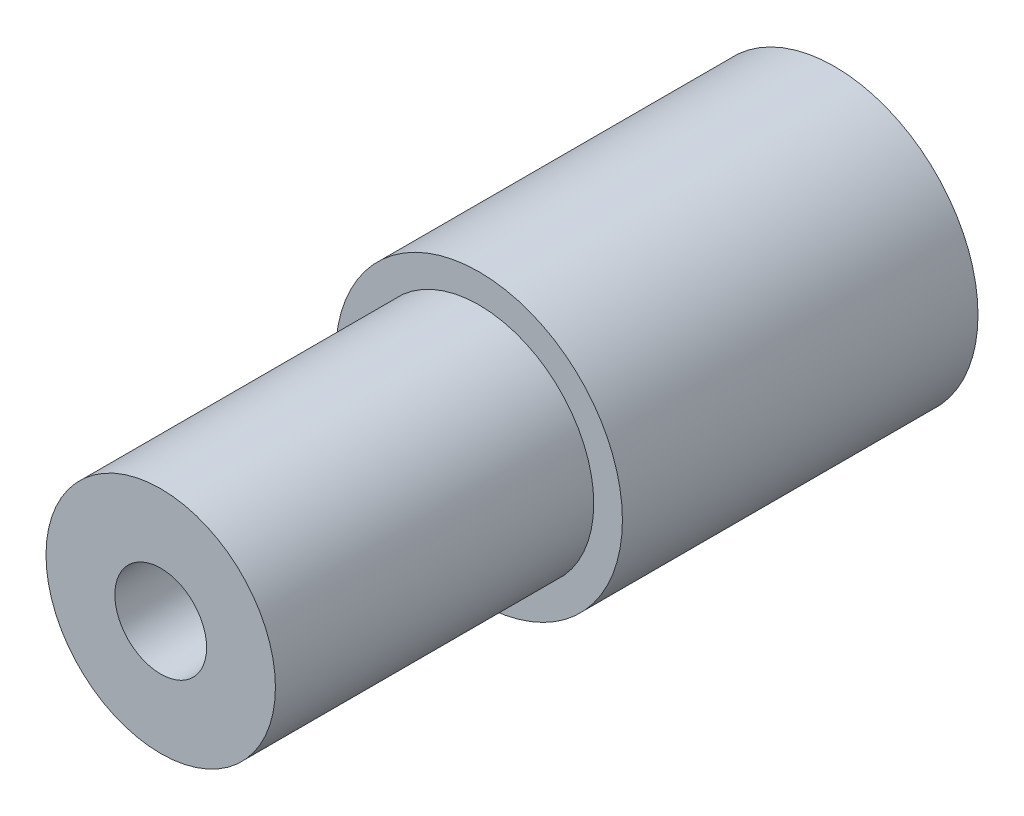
ISO-10303-21;
HEADER;
FILE_DESCRIPTION(('STEP AP214'),'2;1');
FILE_NAME('part.step','',(''),(''),'','','');
FILE_SCHEMA(('AUTOMOTIVE_DESIGN { 1 0 10303 214 1 1 1 1 }'));
ENDSEC;
DATA;
#1=APPLICATION_CONTEXT('core data for automotive mechanical design processes');
#2=APPLICATION_PROTOCOL_DEFINITION('international standard','automotive_design',2000,#1);
#3=PRODUCT_CONTEXT('',#1,'mechanical');
#4=PRODUCT('Part','Part','',(#3));
#5=PRODUCT_RELATED_PRODUCT_CATEGORY('part','',(#4));
#6=PRODUCT_DEFINITION_FORMATION('','',#4);
#7=PRODUCT_DEFINITION_CONTEXT('part definition',#1,'design');
#8=PRODUCT_DEFINITION('design','',#6,#7);
#9=PRODUCT_DEFINITION_SHAPE('','',#8);
#10=(LENGTH_UNIT() NAMED_UNIT(*) SI_UNIT(.MILLI.,.METRE.));
#11=(NAMED_UNIT(*) PLANE_ANGLE_UNIT() SI_UNIT($,.RADIAN.));
#12=(NAMED_UNIT(*) SI_UNIT($,.STERADIAN.) SOLID_ANGLE_UNIT());
#13=UNCERTAINTY_MEASURE_WITH_UNIT(LENGTH_MEASURE(1.E-05),#10,'distance_accuracy_value','');
#14=(GEOMETRIC_REPRESENTATION_CONTEXT(3) GLOBAL_UNCERTAINTY_ASSIGNED_CONTEXT((#13)) GLOBAL_UNIT_ASSIGNED_CONTEXT((#10,
#11,#12)) REPRESENTATION_CONTEXT('',''));
#15=CARTESIAN_POINT('',(0.,0.,0.));
#16=DIRECTION('',(0.,0.,1.));
#17=DIRECTION('',(1.,0.,0.));
#18=AXIS2_PLACEMENT_3D('',#15,#16,#17);
#19=CARTESIAN_POINT('',(0.,0.,23.5));
#20=DIRECTION('',(0.,0.,-1.));
#21=DIRECTION('',(-1.,0.,0.));
#22=AXIS2_PLACEMENT_3D('',#19,#20,#21);
#23=CYLINDRICAL_SURFACE('',#22,4.);
#24=CARTESIAN_POINT('',(0.,0.,23.5));
#25=DIRECTION('',(0.,0.,1.));
#26=DIRECTION('',(1.,0.,0.));
#27=AXIS2_PLACEMENT_3D('',#24,#25,#26);
#28=CIRCLE('',#27,4.);
#29=CARTESIAN_POINT('',(4.,0.,23.5));
#30=VERTEX_POINT('',#29);
#31=EDGE_CURVE('E44',#30,#30,#28,.T.);
#32=ORIENTED_EDGE('',*,*,#31,.F.);
#33=EDGE_LOOP('',(#32));
#34=FACE_BOUND('',#33,.T.);
#35=CARTESIAN_POINT('',(0.,0.,12.4));
#36=DIRECTION('',(0.,0.,-1.));
#37=DIRECTION('',(-1.,0.,0.));
#38=AXIS2_PLACEMENT_3D('',#35,#36,#37);
#39=CIRCLE('',#38,4.);
#40=CARTESIAN_POINT('',(-4.,0.,12.4));
#41=VERTEX_POINT('',#40);
#42=EDGE_CURVE('E10',#41,#41,#39,.T.);
#43=ORIENTED_EDGE('',*,*,#42,.F.);
#44=EDGE_LOOP('',(#43));
#45=FACE_BOUND('',#44,.T.);
#46=ADVANCED_FACE('F37',(#34,#45),#23,.T.);
#47=CARTESIAN_POINT('',(0.,0.,23.5));
#48=DIRECTION('',(0.,0.,1.));
#49=DIRECTION('',(1.,0.,0.));
#50=AXIS2_PLACEMENT_3D('',#47,#48,#49);
#51=PLANE('',#50);
#52=ORIENTED_EDGE('',*,*,#31,.T.);
#53=EDGE_LOOP('',(#52));
#54=FACE_BOUND('',#53,.T.);
#55=CARTESIAN_POINT('',(0.,0.,23.5));
#56=DIRECTION('',(0.,0.,1.));
#57=DIRECTION('',(1.,0.,0.));
#58=AXIS2_PLACEMENT_3D('',#55,#56,#57);
#59=CIRCLE('',#58,1.6);
#60=CARTESIAN_POINT('',(1.6,0.,23.5));
#61=VERTEX_POINT('',#60);
#62=EDGE_CURVE('E49',#61,#61,#59,.T.);
#63=ORIENTED_EDGE('',*,*,#62,.F.);
#64=EDGE_LOOP('',(#63));
#65=FACE_BOUND('',#64,.T.);
#66=ADVANCED_FACE('F81',(#54,#65),#51,.T.);
#67=CARTESIAN_POINT('',(0.,0.,0.));
#68=DIRECTION('',(0.,0.,1.));
#69=DIRECTION('',(1.,0.,0.));
#70=AXIS2_PLACEMENT_3D('',#67,#68,#69);
#71=PLANE('',#70);
#72=CARTESIAN_POINT('',(0.,0.,0.));
#73=DIRECTION('',(0.,0.,1.));
#74=DIRECTION('',(1.,0.,0.));
#75=AXIS2_PLACEMENT_3D('',#72,#73,#74);
#76=CIRCLE('',#75,1.6);
#77=CARTESIAN_POINT('',(1.6,0.,0.));
#78=VERTEX_POINT('',#77);
#79=EDGE_CURVE('E54',#78,#78,#76,.T.);
#80=ORIENTED_EDGE('',*,*,#79,.T.);
#81=EDGE_LOOP('',(#80));
#82=FACE_BOUND('',#81,.T.);
#83=CARTESIAN_POINT('',(0.,0.,0.));
#84=DIRECTION('',(0.,0.,-1.));
#85=DIRECTION('',(-1.,0.,0.));
#86=AXIS2_PLACEMENT_3D('',#83,#84,#85);
#87=CIRCLE('',#86,5.);
#88=CARTESIAN_POINT('',(-5.,0.,0.));
#89=VERTEX_POINT('',#88);
#90=EDGE_CURVE('E61',#89,#89,#87,.T.);
#91=ORIENTED_EDGE('',*,*,#90,.T.);
#92=EDGE_LOOP('',(#91));
#93=FACE_BOUND('',#92,.T.);
#94=ADVANCED_FACE('F86',(#82,#93),#71,.F.);
#95=CARTESIAN_POINT('',(0.,0.,23.5));
#96=DIRECTION('',(0.,0.,-1.));
#97=DIRECTION('',(-1.,0.,0.));
#98=AXIS2_PLACEMENT_3D('',#95,#96,#97);
#99=CYLINDRICAL_SURFACE('',#98,1.6);
#100=ORIENTED_EDGE('',*,*,#62,.T.);
#101=EDGE_LOOP('',(#100));
#102=FACE_BOUND('',#101,.T.);
#103=ORIENTED_EDGE('',*,*,#79,.F.);
#104=EDGE_LOOP('',(#103));
#105=FACE_BOUND('',#104,.T.);
#106=ADVANCED_FACE('F78',(#102,#105),#99,.F.);
#107=CARTESIAN_POINT('',(0.,0.,12.4));
#108=DIRECTION('',(0.,0.,-1.));
#109=DIRECTION('',(-1.,0.,0.));
#110=AXIS2_PLACEMENT_3D('',#107,#108,#109);
#111=CYLINDRICAL_SURFACE('',#110,5.);
#112=CARTESIAN_POINT('',(0.,0.,12.4));
#113=DIRECTION('',(0.,0.,-1.));
#114=DIRECTION('',(-1.,0.,0.));
#115=AXIS2_PLACEMENT_3D('',#112,#113,#114);
#116=CIRCLE('',#115,5.);
#117=CARTESIAN_POINT('',(-5.,0.,12.4));
#118=VERTEX_POINT('',#117);
#119=EDGE_CURVE('E59',#118,#118,#116,.T.);
#120=CARTESIAN_POINT('',(-5.,0.,12.4));
#121=CARTESIAN_POINT('',(-5.,0.,12.2708333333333));
#122=CARTESIAN_POINT('',(-5.,0.,12.1416666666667));
#123=CARTESIAN_POINT('',(-5.,0.,11.8833333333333));
#124=CARTESIAN_POINT('',(-5.,0.,11.7541666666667));
#125=CARTESIAN_POINT('',(-5.,0.,11.4958333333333));
#126=CARTESIAN_POINT('',(-5.,0.,11.3666666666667));
#127=CARTESIAN_POINT('',(-5.,0.,11.1083333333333));
#128=CARTESIAN_POINT('',(-5.,0.,10.9791666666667));
#129=CARTESIAN_POINT('',(-5.,0.,10.7208333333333));
#130=CARTESIAN_POINT('',(-5.,0.,10.5916666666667));
#131=CARTESIAN_POINT('',(-5.,0.,10.3333333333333));
#132=CARTESIAN_POINT('',(-5.,0.,10.2041666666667));
#133=CARTESIAN_POINT('',(-5.,0.,9.94583333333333));
#134=CARTESIAN_POINT('',(-5.,0.,9.81666666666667));
#135=CARTESIAN_POINT('',(-5.,0.,9.55833333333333));
#136=CARTESIAN_POINT('',(-5.,0.,9.42916666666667));
#137=CARTESIAN_POINT('',(-5.,0.,9.17083333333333));
#138=CARTESIAN_POINT('',(-5.,0.,9.04166666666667));
#139=CARTESIAN_POINT('',(-5.,0.,8.78333333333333));
#140=CARTESIAN_POINT('',(-5.,0.,8.65416666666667));
#141=CARTESIAN_POINT('',(-5.,0.,8.39583333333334));
#142=CARTESIAN_POINT('',(-5.,0.,8.26666666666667));
#143=CARTESIAN_POINT('',(-5.,0.,8.00833333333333));
#144=CARTESIAN_POINT('',(-5.,0.,7.87916666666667));
#145=CARTESIAN_POINT('',(-5.,0.,7.62083333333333));
#146=CARTESIAN_POINT('',(-5.,0.,7.49166666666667));
#147=CARTESIAN_POINT('',(-5.,0.,7.23333333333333));
#148=CARTESIAN_POINT('',(-5.,0.,7.10416666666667));
#149=CARTESIAN_POINT('',(-5.,0.,6.84583333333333));
#150=CARTESIAN_POINT('',(-5.,0.,6.71666666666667));
#151=CARTESIAN_POINT('',(-5.,0.,6.45833333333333));
#152=CARTESIAN_POINT('',(-5.,0.,6.32916666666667));
#153=CARTESIAN_POINT('',(-5.,0.,6.07083333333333));
#154=CARTESIAN_POINT('',(-5.,0.,5.94166666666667));
#155=CARTESIAN_POINT('',(-5.,0.,5.68333333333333));
#156=CARTESIAN_POINT('',(-5.,0.,5.55416666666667));
#157=CARTESIAN_POINT('',(-5.,0.,5.29583333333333));
#158=CARTESIAN_POINT('',(-5.,0.,5.16666666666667));
#159=CARTESIAN_POINT('',(-5.,0.,4.90833333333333));
#160=CARTESIAN_POINT('',(-5.,0.,4.77916666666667));
#161=CARTESIAN_POINT('',(-5.,0.,4.52083333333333));
#162=CARTESIAN_POINT('',(-5.,0.,4.39166666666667));
#163=CARTESIAN_POINT('',(-5.,0.,4.13333333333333));
#164=CARTESIAN_POINT('',(-5.,0.,4.00416666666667));
#165=CARTESIAN_POINT('',(-5.,0.,3.74583333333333));
#166=CARTESIAN_POINT('',(-5.,0.,3.61666666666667));
#167=CARTESIAN_POINT('',(-5.,0.,3.35833333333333));
#168=CARTESIAN_POINT('',(-5.,0.,3.22916666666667));
#169=CARTESIAN_POINT('',(-5.,0.,2.97083333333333));
#170=CARTESIAN_POINT('',(-5.,0.,2.84166666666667));
#171=CARTESIAN_POINT('',(-5.,0.,2.58333333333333));
#172=CARTESIAN_POINT('',(-5.,0.,2.45416666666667));
#173=CARTESIAN_POINT('',(-5.,0.,2.19583333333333));
#174=CARTESIAN_POINT('',(-5.,0.,2.06666666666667));
#175=CARTESIAN_POINT('',(-5.,0.,1.80833333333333));
#176=CARTESIAN_POINT('',(-5.,0.,1.67916666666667));
#177=CARTESIAN_POINT('',(-5.,0.,1.42083333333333));
#178=CARTESIAN_POINT('',(-5.,0.,1.29166666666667));
#179=CARTESIAN_POINT('',(-5.,0.,1.03333333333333));
#180=CARTESIAN_POINT('',(-5.,0.,0.904166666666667));
#181=CARTESIAN_POINT('',(-5.,0.,0.645833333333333));
#182=CARTESIAN_POINT('',(-5.,0.,0.516666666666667));
#183=CARTESIAN_POINT('',(-5.,0.,0.258333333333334));
#184=CARTESIAN_POINT('',(-5.,0.,0.129166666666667));
#185=CARTESIAN_POINT('',(-5.,0.,0.));
#186=B_SPLINE_CURVE_WITH_KNOTS('',3,(#120,#121,#122,#123,#124,#125,#126,#127,#128,#129,#130,
#131,#132,#133,#134,#135,#136,#137,#138,#139,#140,#141,#142,#143,#144,#145,#146,#147,#148,#149,
#150,#151,#152,#153,#154,#155,#156,#157,#158,#159,#160,#161,#162,#163,#164,#165,#166,#167,#168,
#169,#170,#171,#172,#173,#174,#175,#176,#177,#178,#179,#180,#181,#182,#183,#184,#185),
.UNSPECIFIED.,.F.,.F.,(4,2,2,2,2,2,2,2,2,2,2,2,2,2,2,2,2,2,2,2,2,2,2,2,2,2,2,2,2,2,2,2,4),(0.,
0.387499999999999,0.775,1.1625,1.55,1.9375,2.325,2.7125,3.1,3.4875,3.875,4.2625,4.65,5.0375,
5.425,5.8125,6.2,6.5875,6.975,7.3625,7.75,8.1375,8.525,8.9125,9.3,9.6875,10.075,10.4625,10.85,
11.2375,11.625,12.0125,12.4),.UNSPECIFIED.);
#187=EDGE_CURVE('BSEAM69',#118,#89,#186,.T.);
#188=ORIENTED_EDGE('',*,*,#119,.T.);
#189=ORIENTED_EDGE('',*,*,#90,.F.);
#190=ORIENTED_EDGE('',*,*,#187,.T.);
#191=ORIENTED_EDGE('',*,*,#187,.F.);
#192=EDGE_LOOP('',(#188,#190,#189,#191));
#193=FACE_BOUND('',#192,.T.);
#194=ADVANCED_FACE('F69',(#193),#111,.T.);
#195=CARTESIAN_POINT('',(0.,0.,12.4));
#196=DIRECTION('',(0.,0.,-1.));
#197=DIRECTION('',(-1.,0.,0.));
#198=AXIS2_PLACEMENT_3D('',#195,#196,#197);
#199=PLANE('',#198);
#200=ORIENTED_EDGE('',*,*,#42,.T.);
#201=EDGE_LOOP('',(#200));
#202=FACE_BOUND('',#201,.T.);
#203=ORIENTED_EDGE('',*,*,#119,.F.);
#204=EDGE_LOOP('',(#203));
#205=FACE_BOUND('',#204,.T.);
#206=ADVANCED_FACE('F72',(#202,#205),#199,.F.);
#207=CLOSED_SHELL('',(#46,#66,#94,#106,#194,#206));
#208=MANIFOLD_SOLID_BREP('B2',#207);
#209=ADVANCED_BREP_SHAPE_REPRESENTATION('',(#18,#208),#14);
#210=SHAPE_DEFINITION_REPRESENTATION(#9,#209);
ENDSEC;
END-ISO-10303-21;
